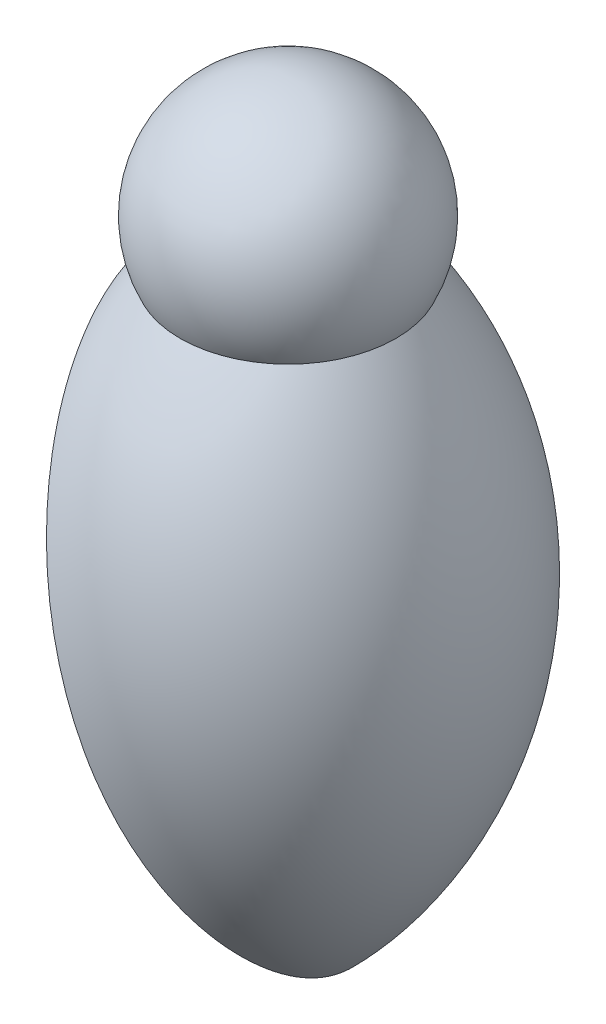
ISO-10303-21;
HEADER;
FILE_DESCRIPTION(('STEP AP214'),'2;1');
FILE_NAME('part.step','',(''),(''),'','','');
FILE_SCHEMA(('AUTOMOTIVE_DESIGN { 1 0 10303 214 1 1 1 1 }'));
ENDSEC;
DATA;
#1=APPLICATION_CONTEXT('core data for automotive mechanical design processes');
#2=APPLICATION_PROTOCOL_DEFINITION('international standard','automotive_design',2000,#1);
#3=PRODUCT_CONTEXT('',#1,'mechanical');
#4=PRODUCT('Part','Part','',(#3));
#5=PRODUCT_RELATED_PRODUCT_CATEGORY('part','',(#4));
#6=PRODUCT_DEFINITION_FORMATION('','',#4);
#7=PRODUCT_DEFINITION_CONTEXT('part definition',#1,'design');
#8=PRODUCT_DEFINITION('design','',#6,#7);
#9=PRODUCT_DEFINITION_SHAPE('','',#8);
#10=(LENGTH_UNIT() NAMED_UNIT(*) SI_UNIT(.MILLI.,.METRE.));
#11=(NAMED_UNIT(*) PLANE_ANGLE_UNIT() SI_UNIT($,.RADIAN.));
#12=(NAMED_UNIT(*) SI_UNIT($,.STERADIAN.) SOLID_ANGLE_UNIT());
#13=UNCERTAINTY_MEASURE_WITH_UNIT(LENGTH_MEASURE(1.E-05),#10,'distance_accuracy_value','');
#14=(GEOMETRIC_REPRESENTATION_CONTEXT(3) GLOBAL_UNCERTAINTY_ASSIGNED_CONTEXT((#13)) GLOBAL_UNIT_ASSIGNED_CONTEXT((#10,
#11,#12)) REPRESENTATION_CONTEXT('',''));
#15=CARTESIAN_POINT('',(0.,0.,0.));
#16=DIRECTION('',(0.,0.,1.));
#17=DIRECTION('',(1.,0.,0.));
#18=AXIS2_PLACEMENT_3D('',#15,#16,#17);
#19=CARTESIAN_POINT('',(0.,86.7297545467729,0.));
#20=DIRECTION('',(0.,-1.,0.));
#21=DIRECTION('',(0.,0.,-1.));
#22=AXIS2_PLACEMENT_3D('',#19,#20,#21);
#23=DEGENERATE_TOROIDAL_SURFACE('',#22,58.7614165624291,104.761416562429,.F.);
#24=CARTESIAN_POINT('',(0.,148.468165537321,0.));
#25=DIRECTION('',(0.,-1.,0.));
#26=DIRECTION('',(0.,0.,-1.));
#27=AXIS2_PLACEMENT_3D('',#24,#25,#26);
#28=CIRCLE('',#27,25.875);
#29=CARTESIAN_POINT('',(0.,148.468165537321,-25.875));
#30=VERTEX_POINT('',#29);
#31=EDGE_CURVE('E11',#30,#30,#28,.T.);
#32=ORIENTED_EDGE('',*,*,#31,.T.);
#33=EDGE_LOOP('',(#32));
#34=FACE_BOUND('',#33,.T.);
#35=CARTESIAN_POINT('',(-29.9138621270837,142.511914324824,0.));
#36=CARTESIAN_POINT('',(-29.9138619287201,142.511913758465,0.414560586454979));
#37=CARTESIAN_POINT('',(-29.910777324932,142.503106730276,0.829128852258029));
#38=CARTESIAN_POINT('',(-29.898464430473,142.467951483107,1.65744340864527));
#39=CARTESIAN_POINT('',(-29.8892354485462,142.441601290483,2.07118960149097));
#40=CARTESIAN_POINT('',(-29.852403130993,142.336439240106,3.31019395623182));
#41=CARTESIAN_POINT('',(-29.8156544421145,142.231515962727,4.13312788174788));
#42=CARTESIAN_POINT('',(-29.7186610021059,141.954584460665,5.76755548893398));
#43=CARTESIAN_POINT('',(-29.6583740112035,141.782455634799,6.57902587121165));
#44=CARTESIAN_POINT('',(-29.5157961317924,141.375373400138,8.18398334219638));
#45=CARTESIAN_POINT('',(-29.4335048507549,141.140418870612,8.97747010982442));
#46=CARTESIAN_POINT('',(-29.2272522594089,140.551535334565,10.723935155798));
#47=CARTESIAN_POINT('',(-29.0980536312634,140.182652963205,11.6712593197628));
#48=CARTESIAN_POINT('',(-28.8124730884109,139.367275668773,13.5275746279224));
#49=CARTESIAN_POINT('',(-28.6560841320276,138.920760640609,14.4365557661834));
#50=CARTESIAN_POINT('',(-28.3193535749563,137.959342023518,16.2143292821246));
#51=CARTESIAN_POINT('',(-28.1389814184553,137.444351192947,17.0830684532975));
#52=CARTESIAN_POINT('',(-27.7575740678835,136.355373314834,18.7777371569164));
#53=CARTESIAN_POINT('',(-27.5565376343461,135.781382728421,19.6036641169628));
#54=CARTESIAN_POINT('',(-27.0416504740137,134.311299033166,21.575791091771));
#55=CARTESIAN_POINT('',(-26.7178309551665,133.38674345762,22.69831940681));
#56=CARTESIAN_POINT('',(-26.2089557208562,131.933824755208,24.3146233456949));
#57=CARTESIAN_POINT('',(-26.035412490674,131.43833158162,24.8423046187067));
#58=CARTESIAN_POINT('',(-25.6812612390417,130.427174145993,25.87552647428));
#59=CARTESIAN_POINT('',(-25.5006533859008,129.911510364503,26.3810675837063));
#60=CARTESIAN_POINT('',(-24.9487223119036,128.335660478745,27.8661510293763));
#61=CARTESIAN_POINT('',(-24.5676930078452,127.247761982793,28.8128893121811));
#62=CARTESIAN_POINT('',(-23.7842012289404,125.010769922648,30.6207741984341));
#63=CARTESIAN_POINT('',(-23.3817391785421,123.86167757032,31.4819224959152));
#64=CARTESIAN_POINT('',(-22.6817051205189,121.862970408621,32.8759506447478));
#65=CARTESIAN_POINT('',(-22.3887142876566,121.026435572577,33.4300463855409));
#66=CARTESIAN_POINT('',(-21.7947836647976,119.330670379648,34.4979345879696));
#67=CARTESIAN_POINT('',(-21.4938432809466,118.471438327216,35.0117240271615));
#68=CARTESIAN_POINT('',(-20.8848201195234,116.732581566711,35.9996561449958));
#69=CARTESIAN_POINT('',(-20.5767351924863,115.852950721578,36.4737866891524));
#70=CARTESIAN_POINT('',(-19.9543231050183,114.075866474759,37.3826788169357));
#71=CARTESIAN_POINT('',(-19.6399960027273,113.17841323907,37.8174407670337));
#72=CARTESIAN_POINT('',(-18.6884011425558,110.461460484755,39.0637258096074));
#73=CARTESIAN_POINT('',(-18.0426488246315,108.617736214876,39.8170401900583));
#74=CARTESIAN_POINT('',(-17.0613996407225,105.816115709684,40.8320138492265));
#75=CARTESIAN_POINT('',(-16.7322159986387,104.876244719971,41.1511698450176));
#76=CARTESIAN_POINT('',(-16.0700206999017,102.985573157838,41.7516290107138));
#77=CARTESIAN_POINT('',(-15.7370083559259,102.034770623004,42.032925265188));
#78=CARTESIAN_POINT('',(-14.7190024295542,99.1282038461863,42.831376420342));
#79=CARTESIAN_POINT('',(-14.0288096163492,97.1575949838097,43.2888824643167));
#80=CARTESIAN_POINT('',(-12.6391476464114,93.1898918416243,44.0486796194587));
#81=CARTESIAN_POINT('',(-11.9396778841,91.1927958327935,44.3509605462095));
#82=CARTESIAN_POINT('',(-10.8867465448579,88.1865115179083,44.6891847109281));
#83=CARTESIAN_POINT('',(-10.5352134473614,87.1828293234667,44.7827199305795));
#84=CARTESIAN_POINT('',(-9.83134318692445,85.1731692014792,44.9316528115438));
#85=CARTESIAN_POINT('',(-9.47900621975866,84.1671918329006,44.9870589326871));
#86=CARTESIAN_POINT('',(-8.42126790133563,81.1471828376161,45.0964176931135));
#87=CARTESIAN_POINT('',(-7.71514755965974,79.1310983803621,45.0935080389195));
#88=CARTESIAN_POINT('',(-6.19235199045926,74.7832779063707,44.9252013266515));
#89=CARTESIAN_POINT('',(-5.37598682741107,72.4524271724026,44.733990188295));
#90=CARTESIAN_POINT('',(-3.75095616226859,67.8127094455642,44.1524810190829));
#91=CARTESIAN_POINT('',(-2.94229163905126,65.5038452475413,43.7621580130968));
#92=CARTESIAN_POINT('',(-1.3359592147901,60.9175139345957,42.7838383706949));
#93=CARTESIAN_POINT('',(-0.538324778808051,58.6401423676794,42.1953380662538));
#94=CARTESIAN_POINT('',(1.03833806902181,54.1385223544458,40.8237166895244));
#95=CARTESIAN_POINT('',(1.81736817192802,51.9142690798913,40.0406133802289));
#96=CARTESIAN_POINT('',(3.38281621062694,47.4446691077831,38.2460086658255));
#97=CARTESIAN_POINT('',(4.16823956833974,45.2021620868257,37.2264945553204));
#98=CARTESIAN_POINT('',(5.32163641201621,41.9090329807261,35.5422807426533));
#99=CARTESIAN_POINT('',(5.70211514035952,40.8227064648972,34.9548063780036));
#100=CARTESIAN_POINT('',(6.45387765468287,38.6763064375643,33.7281047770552));
#101=CARTESIAN_POINT('',(6.82516165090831,37.6162323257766,33.0888787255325));
#102=CARTESIAN_POINT('',(7.55573450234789,35.5303321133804,31.7616261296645));
#103=CARTESIAN_POINT('',(7.91507102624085,34.5043699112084,31.0738398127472));
#104=CARTESIAN_POINT('',(8.62235108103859,32.4849742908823,29.6463504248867));
#105=CARTESIAN_POINT('',(8.9702936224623,31.4915436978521,28.9066428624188));
#106=CARTESIAN_POINT('',(9.65294897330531,29.5424554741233,27.3752860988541));
#107=CARTESIAN_POINT('',(9.98767531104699,28.5867592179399,26.5836923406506));
#108=CARTESIAN_POINT('',(10.4786482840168,27.1849542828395,25.3560178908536));
#109=CARTESIAN_POINT('',(10.6404401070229,26.7230132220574,24.9401156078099));
#110=CARTESIAN_POINT('',(10.9600534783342,25.8104668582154,24.0945881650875));
#111=CARTESIAN_POINT('',(11.1178751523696,25.3598611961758,23.6649634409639));
#112=CARTESIAN_POINT('',(11.4955596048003,24.2815127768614,22.6056618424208));
#113=CARTESIAN_POINT('',(11.7132101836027,23.6600861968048,21.9687313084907));
#114=CARTESIAN_POINT('',(12.1386088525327,22.4455061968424,20.665421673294));
#115=CARTESIAN_POINT('',(12.3463584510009,21.8523484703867,19.9990470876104));
#116=CARTESIAN_POINT('',(12.7509687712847,20.6971224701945,18.6338759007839));
#117=CARTESIAN_POINT('',(12.9478035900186,20.1351281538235,17.9350088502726));
#118=CARTESIAN_POINT('',(13.3281464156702,19.04918966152,16.5045326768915));
#119=CARTESIAN_POINT('',(13.5116538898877,18.5252470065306,15.7729222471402));
#120=CARTESIAN_POINT('',(13.7761087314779,17.7701869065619,14.6446257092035));
#121=CARTESIAN_POINT('',(13.8630140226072,17.5220586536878,14.26065339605));
#122=CARTESIAN_POINT('',(14.0322847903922,17.0387640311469,13.483620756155));
#123=CARTESIAN_POINT('',(14.1146502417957,16.803597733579,13.0905603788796));
#124=CARTESIAN_POINT('',(14.2743761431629,16.347555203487,12.2950428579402));
#125=CARTESIAN_POINT('',(14.3517349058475,16.1266837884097,11.8925826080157));
#126=CARTESIAN_POINT('',(14.5008501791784,15.7009362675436,11.0782798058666));
#127=CARTESIAN_POINT('',(14.5726070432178,15.4960591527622,10.6664378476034));
#128=CARTESIAN_POINT('',(14.7095863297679,15.104961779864,9.83513412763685));
#129=CARTESIAN_POINT('',(14.7748358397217,14.9186641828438,9.41571334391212));
#130=CARTESIAN_POINT('',(14.8984540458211,14.565714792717,8.5676374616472));
#131=CARTESIAN_POINT('',(14.9568224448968,14.3990638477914,8.13898196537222));
#132=CARTESIAN_POINT('',(15.0658715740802,14.0877114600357,7.27315335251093));
#133=CARTESIAN_POINT('',(15.1165582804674,13.942992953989,6.83598715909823));
#134=CARTESIAN_POINT('',(15.2094989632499,13.6776327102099,5.95359687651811));
#135=CARTESIAN_POINT('',(15.2517545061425,13.5569864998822,5.50837430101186));
#136=CARTESIAN_POINT('',(15.3365561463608,13.3148645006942,4.49770499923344));
#137=CARTESIAN_POINT('',(15.3764947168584,13.2008336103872,3.93022206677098));
#138=CARTESIAN_POINT('',(15.4405994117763,13.0178046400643,2.78720841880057));
#139=CARTESIAN_POINT('',(15.4647683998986,12.9487983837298,2.21167918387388));
#140=CARTESIAN_POINT('',(15.4964120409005,12.8584508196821,1.05693989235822));
#141=CARTESIAN_POINT('',(15.5039026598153,12.8370639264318,0.477733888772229));
#142=CARTESIAN_POINT('',(15.5019317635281,12.8426911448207,-0.680432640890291));
#143=CARTESIAN_POINT('',(15.4924695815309,12.869707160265,-1.25939315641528));
#144=CARTESIAN_POINT('',(15.4570199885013,12.9709213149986,-2.41112066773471));
#145=CARTESIAN_POINT('',(15.4310749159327,13.0449985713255,-2.98389971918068));
#146=CARTESIAN_POINT('',(15.3636703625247,13.2374491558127,-4.12096267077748));
#147=CARTESIAN_POINT('',(15.3222106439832,13.3558231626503,-4.68524644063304));
#148=CARTESIAN_POINT('',(15.2250564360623,13.6332136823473,-5.80339272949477));
#149=CARTESIAN_POINT('',(15.1693386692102,13.7922966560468,-6.35723660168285));
#150=CARTESIAN_POINT('',(15.0452351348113,14.1466317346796,-7.45170312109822));
#151=CARTESIAN_POINT('',(14.9768477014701,14.3418885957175,-7.99232401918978));
#152=CARTESIAN_POINT('',(14.7805074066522,14.9024709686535,-9.40863227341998));
#153=CARTESIAN_POINT('',(14.6428566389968,15.2954855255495,-10.2721277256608));
#154=CARTESIAN_POINT('',(14.4181121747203,15.9371662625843,-11.5371708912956));
#155=CARTESIAN_POINT('',(14.3401135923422,16.1598644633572,-11.9539985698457));
#156=CARTESIAN_POINT('',(14.1786229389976,16.6209456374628,-12.7778348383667));
#157=CARTESIAN_POINT('',(14.0951310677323,16.8593280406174,-13.1848437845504));
#158=CARTESIAN_POINT('',(13.9229879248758,17.3508237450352,-13.9902661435));
#159=CARTESIAN_POINT('',(13.8343233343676,17.6039750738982,-14.3886533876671));
#160=CARTESIAN_POINT('',(13.6525184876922,18.1230564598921,-15.1759553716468));
#161=CARTESIAN_POINT('',(13.5593782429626,18.3889864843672,-15.5648701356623));
#162=CARTESIAN_POINT('',(13.3690542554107,18.9323913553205,-16.3334118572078));
#163=CARTESIAN_POINT('',(13.2718712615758,19.2098640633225,-16.7130405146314));
#164=CARTESIAN_POINT('',(13.0737969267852,19.7753973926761,-17.4633499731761));
#165=CARTESIAN_POINT('',(12.9729053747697,20.0634586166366,-17.8340302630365));
#166=CARTESIAN_POINT('',(12.6834934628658,20.8897750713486,-18.8674566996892));
#167=CARTESIAN_POINT('',(12.4910326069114,21.4392810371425,-19.5201444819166));
#168=CARTESIAN_POINT('',(12.0963488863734,22.5661650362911,-20.7979759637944));
#169=CARTESIAN_POINT('',(11.894124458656,23.1435475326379,-21.4231152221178));
#170=CARTESIAN_POINT('',(11.4809660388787,24.3231796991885,-22.6472153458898));
#171=CARTESIAN_POINT('',(11.2700267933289,24.9254443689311,-23.2461599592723));
#172=CARTESIAN_POINT('',(10.8404935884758,26.1518291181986,-24.4182652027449));
#173=CARTESIAN_POINT('',(10.6218999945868,26.7759481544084,-24.991427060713));
#174=CARTESIAN_POINT('',(10.1775676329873,28.0445868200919,-26.1132213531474));
#175=CARTESIAN_POINT('',(9.95182175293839,28.6891267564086,-26.6618279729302));
#176=CARTESIAN_POINT('',(9.49402088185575,29.9962201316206,-27.7343670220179));
#177=CARTESIAN_POINT('',(9.26196588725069,30.6587735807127,-28.2582994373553));
#178=CARTESIAN_POINT('',(8.79211950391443,32.0002587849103,-29.2817405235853));
#179=CARTESIAN_POINT('',(8.55432930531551,32.6791871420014,-29.7812541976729));
#180=CARTESIAN_POINT('',(8.07341689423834,34.0522675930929,-30.7562275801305));
#181=CARTESIAN_POINT('',(7.83029446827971,34.7464202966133,-31.231686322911));
#182=CARTESIAN_POINT('',(7.24034689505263,36.4308132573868,-32.3451307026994));
#183=CARTESIAN_POINT('',(6.89113432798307,37.4278699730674,-32.9715885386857));
#184=CARTESIAN_POINT('',(6.18401007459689,39.4468207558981,-34.1777375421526));
#185=CARTESIAN_POINT('',(5.82609778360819,40.4687165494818,-34.7574254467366));
#186=CARTESIAN_POINT('',(4.74040099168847,43.5685513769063,-36.4267415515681));
#187=CARTESIAN_POINT('',(4.00071953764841,45.6804580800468,-37.4465039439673));
#188=CARTESIAN_POINT('',(2.49642236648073,49.9754627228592,-39.2976926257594));
#189=CARTESIAN_POINT('',(1.7318126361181,52.158543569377,-40.1291637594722));
#190=CARTESIAN_POINT('',(0.182934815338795,56.5808329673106,-41.6020739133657));
#191=CARTESIAN_POINT('',(-0.601331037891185,58.820035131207,-42.2435344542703));
#192=CARTESIAN_POINT('',(-2.19091313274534,63.3585416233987,-43.3384915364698));
#193=CARTESIAN_POINT('',(-2.9963500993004,65.658190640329,-43.7903829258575));
#194=CARTESIAN_POINT('',(-4.61669507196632,70.2845299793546,-44.4957748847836));
#195=CARTESIAN_POINT('',(-5.43160341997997,72.611221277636,-44.7492682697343));
#196=CARTESIAN_POINT('',(-7.0660841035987,77.2779202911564,-45.0552780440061));
#197=CARTESIAN_POINT('',(-7.88565914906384,79.6179357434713,-45.1076624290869));
#198=CARTESIAN_POINT('',(-9.52347518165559,84.294157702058,-45.00850651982));
#199=CARTESIAN_POINT('',(-10.3417161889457,86.6303642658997,-44.8569693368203));
#200=CARTESIAN_POINT('',(-12.0003283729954,91.3659625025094,-44.3383258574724));
#201=CARTESIAN_POINT('',(-12.8404439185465,93.7646243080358,-43.9637008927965));
#202=CARTESIAN_POINT('',(-14.5067044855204,98.5220598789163,-42.98970296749));
#203=CARTESIAN_POINT('',(-15.3328467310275,100.880825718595,-42.3902858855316));
#204=CARTESIAN_POINT('',(-16.5550278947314,104.370344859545,-41.3207028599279));
#205=CARTESIAN_POINT('',(-16.9594108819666,105.524921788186,-40.9359697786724));
#206=CARTESIAN_POINT('',(-17.7617594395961,107.815752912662,-40.1090180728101));
#207=CARTESIAN_POINT('',(-18.159724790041,108.952006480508,-39.6667974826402));
#208=CARTESIAN_POINT('',(-18.9478867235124,111.202332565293,-38.724522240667));
#209=CARTESIAN_POINT('',(-19.3380869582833,112.316415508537,-38.2244955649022));
#210=CARTESIAN_POINT('',(-20.1096391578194,114.519318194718,-37.1657970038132));
#211=CARTESIAN_POINT('',(-20.490992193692,115.608140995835,-36.6071322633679));
#212=CARTESIAN_POINT('',(-21.3400277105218,118.032270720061,-35.2793496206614));
#213=CARTESIAN_POINT('',(-21.8047862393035,119.359229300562,-34.4929905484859));
#214=CARTESIAN_POINT('',(-22.715069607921,121.958231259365,-32.8243352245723));
#215=CARTESIAN_POINT('',(-23.1605957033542,123.230278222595,-31.9420452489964));
#216=CARTESIAN_POINT('',(-24.0281618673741,125.707315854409,-30.0799768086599));
#217=CARTESIAN_POINT('',(-24.450230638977,126.91238847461,-29.1003217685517));
#218=CARTESIAN_POINT('',(-25.0623493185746,128.66008342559,-27.5554268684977));
#219=CARTESIAN_POINT('',(-25.2628843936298,129.232642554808,-27.0279142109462));
#220=CARTESIAN_POINT('',(-25.65626648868,130.355810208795,-25.9473032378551));
#221=CARTESIAN_POINT('',(-25.8491138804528,130.906419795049,-25.3942061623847));
#222=CARTESIAN_POINT('',(-26.301530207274,132.198139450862,-24.0362954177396));
#223=CARTESIAN_POINT('',(-26.5570571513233,132.927709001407,-23.2190186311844));
#224=CARTESIAN_POINT('',(-26.9258374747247,133.980634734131,-21.9547085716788));
#225=CARTESIAN_POINT('',(-27.0463434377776,134.324698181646,-21.5268824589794));
#226=CARTESIAN_POINT('',(-27.2822010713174,134.998108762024,-20.6581579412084));
#227=CARTESIAN_POINT('',(-27.3975508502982,135.327450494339,-20.2172548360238));
#228=CARTESIAN_POINT('',(-27.7349596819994,136.290805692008,-18.876033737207));
#229=CARTESIAN_POINT('',(-27.9486675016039,136.900975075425,-17.9562187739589));
#230=CARTESIAN_POINT('',(-28.3498931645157,138.046537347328,-16.0659368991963));
#231=CARTESIAN_POINT('',(-28.5374214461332,138.581960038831,-15.0954903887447));
#232=CARTESIAN_POINT('',(-28.8413545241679,139.449736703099,-13.3412684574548));
#233=CARTESIAN_POINT('',(-28.9640969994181,139.800185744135,-12.5675336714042));
#234=CARTESIAN_POINT('',(-29.1897923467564,140.444581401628,-10.9939144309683));
#235=CARTESIAN_POINT('',(-29.2927451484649,140.738527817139,-10.1940298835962));
#236=CARTESIAN_POINT('',(-29.4765606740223,141.263350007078,-8.57335007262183));
#237=CARTESIAN_POINT('',(-29.5574748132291,141.494372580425,-7.75260844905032));
#238=CARTESIAN_POINT('',(-29.6955993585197,141.888739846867,-6.0933623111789));
#239=CARTESIAN_POINT('',(-29.7528210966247,142.052116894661,-5.25486649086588));
#240=CARTESIAN_POINT('',(-29.8359768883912,142.289539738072,-3.68139136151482));
#241=CARTESIAN_POINT('',(-29.8651238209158,142.37275880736,-2.94797174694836));
#242=CARTESIAN_POINT('',(-29.8943334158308,142.456156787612,-1.84443143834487));
#243=CARTESIAN_POINT('',(-29.9016514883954,142.477051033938,-1.47596413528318));
#244=CARTESIAN_POINT('',(-29.9114165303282,142.504931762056,-0.7383333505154));
#245=CARTESIAN_POINT('',(-29.9138623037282,142.511914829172,-0.369169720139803));
#246=CARTESIAN_POINT('',(-29.9138621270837,142.511914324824,0.));
#247=B_SPLINE_CURVE_WITH_KNOTS('',3,(#35,#36,#37,#38,#39,#40,#41,#42,#43,#44,#45,#46,#47,#48,
#49,#50,#51,#52,#53,#54,#55,#56,#57,#58,#59,#60,#61,#62,#63,#64,#65,#66,#67,#68,#69,#70,#71,#72,
#73,#74,#75,#76,#77,#78,#79,#80,#81,#82,#83,#84,#85,#86,#87,#88,#89,#90,#91,#92,#93,#94,#95,#96,
#97,#98,#99,#100,#101,#102,#103,#104,#105,#106,#107,#108,#109,#110,#111,#112,#113,#114,#115,
#116,#117,#118,#119,#120,#121,#122,#123,#124,#125,#126,#127,#128,#129,#130,#131,#132,#133,#134,
#135,#136,#137,#138,#139,#140,#141,#142,#143,#144,#145,#146,#147,#148,#149,#150,#151,#152,#153,
#154,#155,#156,#157,#158,#159,#160,#161,#162,#163,#164,#165,#166,#167,#168,#169,#170,#171,#172,
#173,#174,#175,#176,#177,#178,#179,#180,#181,#182,#183,#184,#185,#186,#187,#188,#189,#190,#191,
#192,#193,#194,#195,#196,#197,#198,#199,#200,#201,#202,#203,#204,#205,#206,#207,#208,#209,#210,
#211,#212,#213,#214,#215,#216,#217,#218,#219,#220,#221,#222,#223,#224,#225,#226,#227,#228,#229,
#230,#231,#232,#233,#234,#235,#236,#237,#238,#239,#240,#241,#242,#243,#244,#245,#246),
.UNSPECIFIED.,.T.,.F.,(4,2,2,2,2,2,2,2,2,2,2,2,2,2,2,2,2,2,2,2,2,2,2,2,2,2,2,2,2,2,2,2,2,2,2,2,
2,2,2,2,2,2,2,2,2,2,2,2,2,2,2,2,2,2,2,2,2,2,2,2,2,2,2,2,2,2,2,2,2,2,2,2,2,2,2,2,2,2,2,2,2,2,2,2,
2,2,2,2,2,2,2,2,2,2,2,2,2,2,2,2,2,2,2,2,2,4),(0.,1.24357709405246,2.48729411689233,
4.97499722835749,7.4671852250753,9.95941768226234,13.0292206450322,16.0998198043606,
19.1743692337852,22.2491031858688,26.7114138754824,28.9440287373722,31.1765904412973,
35.6469572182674,40.1172354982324,43.2521266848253,46.3872527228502,49.523334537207,
52.6593871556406,58.9328150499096,62.0694753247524,65.2067077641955,71.6128667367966,
78.0194459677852,81.2215554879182,84.4229543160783,90.8258286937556,98.2488265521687,
105.672755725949,113.115697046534,120.557959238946,128.303759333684,132.179527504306,
136.055206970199,139.912901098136,143.77092935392,147.624900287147,149.551563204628,
151.478165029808,154.225522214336,156.972459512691,159.725659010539,162.478968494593,
163.87479451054,165.270628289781,166.66693004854,168.063143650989,169.453278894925,
170.843474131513,172.232582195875,173.621431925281,175.360096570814,177.098445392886,
178.835129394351,180.571881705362,182.30419087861,184.036526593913,185.771708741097,
187.507119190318,190.377922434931,191.814611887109,193.251249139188,194.691764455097,
196.132276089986,197.572522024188,199.012850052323,201.635645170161,204.258861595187,
206.883683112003,209.508379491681,212.13577331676,214.763168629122,217.390023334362,
220.016983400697,223.70031101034,227.383895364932,234.751734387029,242.117816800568,
249.483064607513,256.909475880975,264.336156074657,271.767710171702,279.199150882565,
286.896474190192,294.59530909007,298.441385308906,302.287593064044,306.131947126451,
309.975833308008,314.804880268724,319.633611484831,324.456297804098,326.867461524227,
329.27850849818,332.650521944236,334.33645534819,336.023002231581,339.392152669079,
342.759955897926,345.332399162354,347.904851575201,350.471250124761,353.036419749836,
355.250085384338,356.357229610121,357.464645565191),.UNSPECIFIED.);
#248=CARTESIAN_POINT('',(-29.9138621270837,142.511914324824,0.));
#249=VERTEX_POINT('',#248);
#250=EDGE_CURVE('E38',#249,#249,#247,.T.);
#251=ORIENTED_EDGE('',*,*,#250,.T.);
#252=EDGE_LOOP('',(#251));
#253=FACE_BOUND('',#252,.T.);
#254=ADVANCED_FACE('F34',(#34,#253),#23,.F.);
#255=CARTESIAN_POINT('',(0.,161.,0.));
#256=DIRECTION('',(0.,-1.,0.));
#257=DIRECTION('',(1.,0.,0.));
#258=AXIS2_PLACEMENT_3D('',#255,#256,#257);
#259=SPHERICAL_SURFACE('',#258,28.75);
#260=ORIENTED_EDGE('',*,*,#31,.F.);
#261=EDGE_LOOP('',(#260));
#262=FACE_BOUND('',#261,.T.);
#263=ADVANCED_FACE('F53',(#262),#259,.T.);
#264=CARTESIAN_POINT('',(17.814666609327,6.23946999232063,0.));
#265=DIRECTION('',(-0.943786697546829,-0.330555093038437,0.));
#266=DIRECTION('',(0.330555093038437,-0.943786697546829,0.));
#267=AXIS2_PLACEMENT_3D('',#264,#265,#266);
#268=PLANE('',#267);
#269=ORIENTED_EDGE('',*,*,#250,.F.);
#270=EDGE_LOOP('',(#269));
#271=FACE_BOUND('',#270,.T.);
#272=ADVANCED_FACE('F51',(#271),#268,.T.);
#273=CLOSED_SHELL('',(#254,#263,#272));
#274=MANIFOLD_SOLID_BREP('B2',#273);
#275=ADVANCED_BREP_SHAPE_REPRESENTATION('',(#18,#274),#14);
#276=SHAPE_DEFINITION_REPRESENTATION(#9,#275);
ENDSEC;
END-ISO-10303-21;
